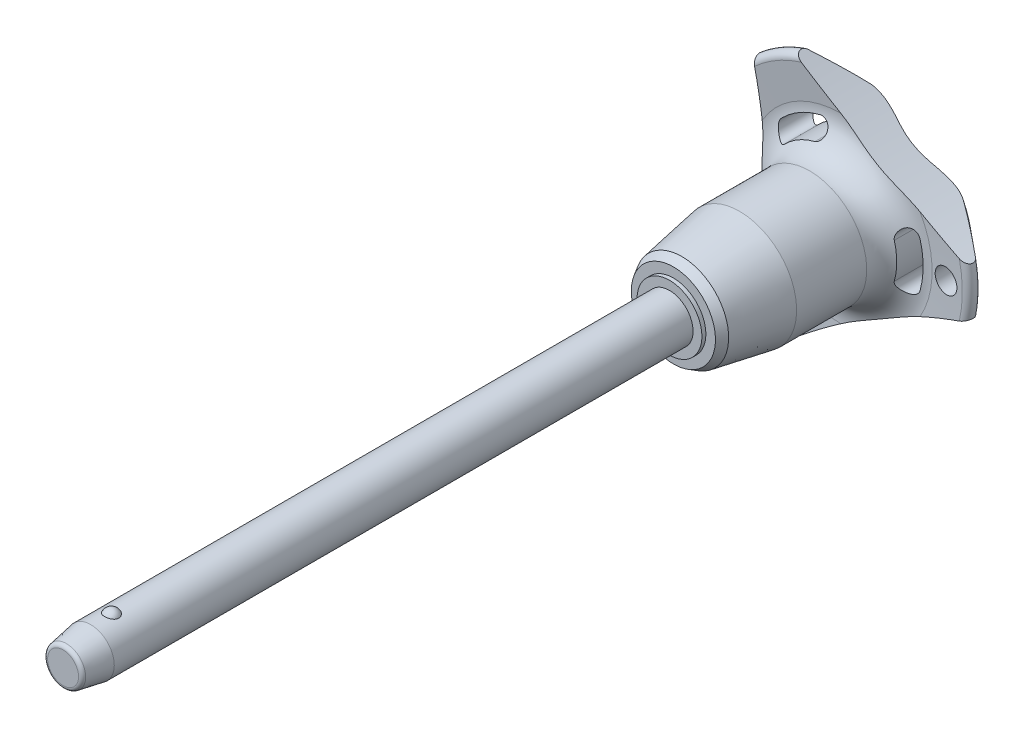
from build123d import *

# Parameters (mm, degrees)
SKETCH1_R           = 3
BOSS_EXTRUDE1_DEPTH = 70
SKETCH2_R           = 2.5
BOSS_EXTRUDE2_DEPTH = 26.7
BOSS_EXTRUDE3_START = 7
SKETCH1_2_R         = 3
BOSS_EXTRUDE3_DEPTH = 7
CHAMFER1_SIZE       = 3.5
CHAMFER1_SIZE2      = 0.617144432
FILLET1_R           = 0.5
SKETCH6_R           = 79.96
CUT_EXTRUDE1_DEPTH  = 100.509565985
CIRPATTERN1_COUNT   = 3
SKETCH7_R           = 1.5
CUT_EXTRUDE2_DEPTH  = 100.35648861


with BuildPart() as part:
    # Sketch1 → Boss-Extrude1 (new body)
    with BuildSketch(Plane.XY):
        Circle(SKETCH1_R)
    extrude(amount=-BOSS_EXTRUDE1_DEPTH)

    # Sketch2 → Boss-Extrude2 (add)
    with BuildSketch(Plane(origin=(0, 0, -70), x_dir=(-1, 0, 0), z_dir=(0, 0, -1))):
        Circle(SKETCH2_R)
    extrude(amount=BOSS_EXTRUDE2_DEPTH)

    # Sketch3 → Revolve1 (revolve)
    with BuildSketch(Plane(origin=(0, 0, 0), x_dir=(0, 0, -1), z_dir=(1, 0, 0))):
        with BuildLine():
            Line((-0.866025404, 3.5), (-0.866025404, 1.5))
            ThreePointArc((-0.866025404, 1.5), (0.133974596, 2.5), (-0.866025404, 3.5))
        make_face()
        with BuildLine():
            Line((-0.866025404, -1.5), (-0.866025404, -3.5))
            ThreePointArc((-0.866025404, -3.5), (0.133974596, -2.5), (-0.866025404, -1.5))
        make_face()
    revolve(axis=Axis((0, -1.5, 0.866025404), (0, 1, 0)))

    # Sketch1_2 → Boss-Extrude3 (add)
    with BuildSketch(Plane.XY.offset(BOSS_EXTRUDE3_START)):
        Circle(SKETCH1_2_R)
    extrude(amount=-BOSS_EXTRUDE3_DEPTH)

    # Chamfer1
    chamfer1_edges = [part.edges().sort_by_distance(p)[0] for p in [
        (-3, 0, 7),
    ]]
    chamfer1_side = [part.faces().sort_by_distance(p)[0] for p in [
        (-3, 0, -31.5),
    ]]
    chamfer(chamfer1_edges, length=CHAMFER1_SIZE, length2=CHAMFER1_SIZE2, reference=chamfer1_side[0])

    # Fillet1
    fillet1_edges = [part.edges().sort_by_distance(p)[0] for p in [
        (-2.382855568, 0, 7),
        (2.5, 0, -96.7),
    ]]
    fillet(fillet1_edges, radius=FILLET1_R)

    # Sketch4 → Revolve2 (revolve)
    with BuildSketch(Plane(origin=(0, 0, 0), x_dir=(0, 0, -1), z_dir=(1, 0, 0)), mode=Mode.PRIVATE) as revolve2_sk:
        Polygon((70, 0), (70, 4.118359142), (70.5, 4.118359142), (70.5, 5.343400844), (71.560917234, 5.955921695), (78.9, 7.25), (87.8, 7.25), (87.8, 0), align=None)
    revolve(revolve2_sk.sketch.rotate(Axis((0, 0, -87.8), (0, 0, 1)), 90), axis=Axis((0, 0, -87.8), (0, 0, 1)))

    # Sketch5 → Revolve3 (revolve)
    with BuildSketch(Plane(origin=(0, 0, 0), x_dir=(0, 0, -1), z_dir=(1, 0, 0)), mode=Mode.PRIVATE) as revolve3_sk:
        with BuildLine():
            Line((91.78715932, 11.570250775), (91.452568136, 15.735949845))
            ThreePointArc((91.452568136, 15.735949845), (91.946485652, 16.540188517), (92.862835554, 16.314230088))
            Line((92.862835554, 16.314230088), (96.326414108, 12.186497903))
            ThreePointArc((96.326414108, 12.186497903), (96.7, 11.109282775), (96.261488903, 10.056825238))
            ThreePointArc((96.261488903, 10.056825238), (93.289873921, 5.413681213), (92.25, 0))
            Line((92.25, 0), (87.8, 0))
            Line((87.8, 0), (87.8, 7.25))
            ThreePointArc((87.8, 7.25), (90.739473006, 8.537160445), (91.78715932, 11.570250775))
        make_face()
    revolve(revolve3_sk.sketch.rotate(Axis((0, 0, -92.25), (0, 0, 1)), 90), axis=Axis((0, 0, -92.25), (0, 0, 1)))

    # Sketch6 → Cut-Extrude1 (cut, through all)
    with BuildSketch(Plane.XY):
        with Locations((-89.76, 0)):
            Circle(SKETCH6_R)
        with BuildLine():
            ThreePointArc((10.099921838, -2.834717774), (10.490188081, 0), (10.099921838, 2.834717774))
            ThreePointArc((10.099921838, 2.834717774), (8.768180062, 3.582738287), (8.020159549, 2.250996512))
            ThreePointArc((8.020159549, 2.250996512), (8.330062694, 0), (8.020159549, -2.250996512))
            ThreePointArc((8.020159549, -2.250996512), (8.768180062, -3.582738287), (10.099921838, -2.834717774))
        make_face()
    cut_extrude1 = extrude(amount=-CUT_EXTRUDE1_DEPTH, mode=Mode.SUBTRACT)

    # CirPattern1: Cut-Extrude1 ×3 about axis
    cirpattern1_axis = Axis((0, 0, 0), (0, 0, 1))
    for i in range(1, CIRPATTERN1_COUNT):
        add(cut_extrude1.rotate(cirpattern1_axis, i * 360 / CIRPATTERN1_COUNT), mode=Mode.SUBTRACT)

    # Sketch7 → Cut-Extrude2 (cut, through all)
    with BuildSketch(Plane.XY):
        with Locations(Location((13.490188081, 0, 0), (0, 0, 225.221865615))):
            Circle(SKETCH7_R)
    extrude(amount=-CUT_EXTRUDE2_DEPTH, mode=Mode.SUBTRACT)


solid = part.part
